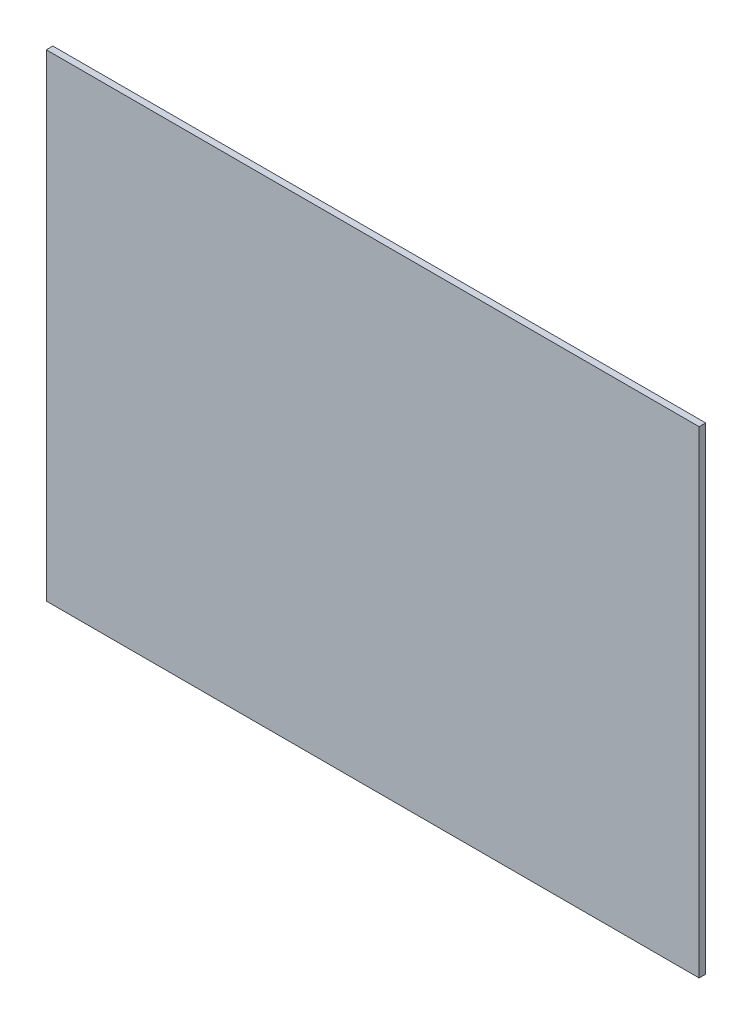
ISO-10303-21;
HEADER;
FILE_DESCRIPTION(('STEP AP214'),'2;1');
FILE_NAME('part.step','',(''),(''),'','','');
FILE_SCHEMA(('AUTOMOTIVE_DESIGN { 1 0 10303 214 1 1 1 1 }'));
ENDSEC;
DATA;
#1=APPLICATION_CONTEXT('core data for automotive mechanical design processes');
#2=APPLICATION_PROTOCOL_DEFINITION('international standard','automotive_design',2000,#1);
#3=PRODUCT_CONTEXT('',#1,'mechanical');
#4=PRODUCT('Part','Part','',(#3));
#5=PRODUCT_RELATED_PRODUCT_CATEGORY('part','',(#4));
#6=PRODUCT_DEFINITION_FORMATION('','',#4);
#7=PRODUCT_DEFINITION_CONTEXT('part definition',#1,'design');
#8=PRODUCT_DEFINITION('design','',#6,#7);
#9=PRODUCT_DEFINITION_SHAPE('','',#8);
#10=(LENGTH_UNIT() NAMED_UNIT(*) SI_UNIT(.MILLI.,.METRE.));
#11=(NAMED_UNIT(*) PLANE_ANGLE_UNIT() SI_UNIT($,.RADIAN.));
#12=(NAMED_UNIT(*) SI_UNIT($,.STERADIAN.) SOLID_ANGLE_UNIT());
#13=UNCERTAINTY_MEASURE_WITH_UNIT(LENGTH_MEASURE(1.E-05),#10,'distance_accuracy_value','');
#14=(GEOMETRIC_REPRESENTATION_CONTEXT(3) GLOBAL_UNCERTAINTY_ASSIGNED_CONTEXT((#13)) GLOBAL_UNIT_ASSIGNED_CONTEXT((#10,
#11,#12)) REPRESENTATION_CONTEXT('',''));
#15=CARTESIAN_POINT('',(0.,0.,0.));
#16=DIRECTION('',(0.,0.,1.));
#17=DIRECTION('',(1.,0.,0.));
#18=AXIS2_PLACEMENT_3D('',#15,#16,#17);
#19=CARTESIAN_POINT('',(-423.235950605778,344.955172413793,10.));
#20=DIRECTION('',(1.,0.,0.));
#21=DIRECTION('',(0.,1.,0.));
#22=AXIS2_PLACEMENT_3D('',#19,#20,#21);
#23=PLANE('',#22);
#24=DIRECTION('',(0.,-1.,0.));
#25=VECTOR('',#24,1.);
#26=CARTESIAN_POINT('',(-423.235950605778,344.955172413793,0.));
#27=LINE('',#26,#25);
#28=CARTESIAN_POINT('',(-423.235950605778,344.955172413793,0.));
#29=VERTEX_POINT('',#28);
#30=CARTESIAN_POINT('',(-423.235950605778,-385.044827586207,0.));
#31=VERTEX_POINT('',#30);
#32=EDGE_CURVE('E115',#29,#31,#27,.T.);
#33=ORIENTED_EDGE('',*,*,#32,.T.);
#34=DIRECTION('',(0.,0.,-1.));
#35=VECTOR('',#34,1.);
#36=CARTESIAN_POINT('',(-423.235950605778,-385.044827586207,10.));
#37=LINE('',#36,#35);
#38=CARTESIAN_POINT('',(-423.235950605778,-385.044827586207,10.));
#39=VERTEX_POINT('',#38);
#40=EDGE_CURVE('E11',#39,#31,#37,.T.);
#41=ORIENTED_EDGE('',*,*,#40,.F.);
#42=DIRECTION('',(0.,-1.,0.));
#43=VECTOR('',#42,1.);
#44=CARTESIAN_POINT('',(-423.235950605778,344.955172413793,10.));
#45=LINE('',#44,#43);
#46=CARTESIAN_POINT('',(-423.235950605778,344.955172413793,10.));
#47=VERTEX_POINT('',#46);
#48=EDGE_CURVE('E99',#47,#39,#45,.T.);
#49=ORIENTED_EDGE('',*,*,#48,.F.);
#50=DIRECTION('',(0.,0.,-1.));
#51=VECTOR('',#50,1.);
#52=CARTESIAN_POINT('',(-423.235950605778,344.955172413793,10.));
#53=LINE('',#52,#51);
#54=EDGE_CURVE('E111',#47,#29,#53,.T.);
#55=ORIENTED_EDGE('',*,*,#54,.T.);
#56=EDGE_LOOP('',(#33,#41,#49,#55));
#57=FACE_BOUND('',#56,.T.);
#58=ADVANCED_FACE('F47',(#57),#23,.F.);
#59=CARTESIAN_POINT('',(-423.235950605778,-385.044827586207,10.));
#60=DIRECTION('',(0.,1.,0.));
#61=DIRECTION('',(0.,0.,1.));
#62=AXIS2_PLACEMENT_3D('',#59,#60,#61);
#63=PLANE('',#62);
#64=DIRECTION('',(1.,0.,0.));
#65=VECTOR('',#64,1.);
#66=CARTESIAN_POINT('',(-423.235950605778,-385.044827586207,0.));
#67=LINE('',#66,#65);
#68=CARTESIAN_POINT('',(574.964049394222,-385.044827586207,0.));
#69=VERTEX_POINT('',#68);
#70=EDGE_CURVE('E104',#31,#69,#67,.T.);
#71=ORIENTED_EDGE('',*,*,#70,.T.);
#72=DIRECTION('',(0.,0.,-1.));
#73=VECTOR('',#72,1.);
#74=CARTESIAN_POINT('',(574.964049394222,-385.044827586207,10.));
#75=LINE('',#74,#73);
#76=CARTESIAN_POINT('',(574.964049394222,-385.044827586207,10.));
#77=VERTEX_POINT('',#76);
#78=EDGE_CURVE('E56',#77,#69,#75,.T.);
#79=ORIENTED_EDGE('',*,*,#78,.F.);
#80=DIRECTION('',(1.,0.,0.));
#81=VECTOR('',#80,1.);
#82=CARTESIAN_POINT('',(-423.235950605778,-385.044827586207,10.));
#83=LINE('',#82,#81);
#84=EDGE_CURVE('E94',#39,#77,#83,.T.);
#85=ORIENTED_EDGE('',*,*,#84,.F.);
#86=ORIENTED_EDGE('',*,*,#40,.T.);
#87=EDGE_LOOP('',(#71,#79,#85,#86));
#88=FACE_BOUND('',#87,.T.);
#89=ADVANCED_FACE('F103',(#88),#63,.F.);
#90=CARTESIAN_POINT('',(574.964049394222,344.955172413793,10.));
#91=DIRECTION('',(-1.,0.,0.));
#92=DIRECTION('',(0.,-1.,0.));
#93=AXIS2_PLACEMENT_3D('',#90,#91,#92);
#94=PLANE('',#93);
#95=DIRECTION('',(0.,1.,0.));
#96=VECTOR('',#95,1.);
#97=CARTESIAN_POINT('',(574.964049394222,344.955172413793,0.));
#98=LINE('',#97,#96);
#99=CARTESIAN_POINT('',(574.964049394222,344.955172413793,0.));
#100=VERTEX_POINT('',#99);
#101=EDGE_CURVE('E81',#69,#100,#98,.T.);
#102=ORIENTED_EDGE('',*,*,#101,.T.);
#103=DIRECTION('',(0.,0.,-1.));
#104=VECTOR('',#103,1.);
#105=CARTESIAN_POINT('',(574.964049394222,344.955172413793,10.));
#106=LINE('',#105,#104);
#107=CARTESIAN_POINT('',(574.964049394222,344.955172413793,10.));
#108=VERTEX_POINT('',#107);
#109=EDGE_CURVE('E106',#108,#100,#106,.T.);
#110=ORIENTED_EDGE('',*,*,#109,.F.);
#111=DIRECTION('',(0.,1.,0.));
#112=VECTOR('',#111,1.);
#113=CARTESIAN_POINT('',(574.964049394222,344.955172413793,10.));
#114=LINE('',#113,#112);
#115=EDGE_CURVE('E97',#77,#108,#114,.T.);
#116=ORIENTED_EDGE('',*,*,#115,.F.);
#117=ORIENTED_EDGE('',*,*,#78,.T.);
#118=EDGE_LOOP('',(#102,#110,#116,#117));
#119=FACE_BOUND('',#118,.T.);
#120=ADVANCED_FACE('F107',(#119),#94,.F.);
#121=CARTESIAN_POINT('',(-423.235950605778,344.955172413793,10.));
#122=DIRECTION('',(0.,-1.,0.));
#123=DIRECTION('',(0.,0.,-1.));
#124=AXIS2_PLACEMENT_3D('',#121,#122,#123);
#125=PLANE('',#124);
#126=DIRECTION('',(-1.,0.,0.));
#127=VECTOR('',#126,1.);
#128=CARTESIAN_POINT('',(-423.235950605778,344.955172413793,0.));
#129=LINE('',#128,#127);
#130=EDGE_CURVE('E87',#100,#29,#129,.T.);
#131=ORIENTED_EDGE('',*,*,#130,.T.);
#132=ORIENTED_EDGE('',*,*,#54,.F.);
#133=DIRECTION('',(-1.,0.,0.));
#134=VECTOR('',#133,1.);
#135=CARTESIAN_POINT('',(-423.235950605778,344.955172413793,10.));
#136=LINE('',#135,#134);
#137=EDGE_CURVE('E64',#108,#47,#136,.T.);
#138=ORIENTED_EDGE('',*,*,#137,.F.);
#139=ORIENTED_EDGE('',*,*,#109,.T.);
#140=EDGE_LOOP('',(#131,#132,#138,#139));
#141=FACE_BOUND('',#140,.T.);
#142=ADVANCED_FACE('F128',(#141),#125,.F.);
#143=CARTESIAN_POINT('',(0.,0.,10.));
#144=DIRECTION('',(0.,0.,1.));
#145=DIRECTION('',(1.,0.,0.));
#146=AXIS2_PLACEMENT_3D('',#143,#144,#145);
#147=PLANE('',#146);
#148=ORIENTED_EDGE('',*,*,#48,.T.);
#149=ORIENTED_EDGE('',*,*,#84,.T.);
#150=ORIENTED_EDGE('',*,*,#115,.T.);
#151=ORIENTED_EDGE('',*,*,#137,.T.);
#152=EDGE_LOOP('',(#148,#149,#150,#151));
#153=FACE_BOUND('',#152,.T.);
#154=ADVANCED_FACE('F95',(#153),#147,.T.);
#155=CARTESIAN_POINT('',(0.,0.,0.));
#156=DIRECTION('',(0.,0.,1.));
#157=DIRECTION('',(1.,0.,0.));
#158=AXIS2_PLACEMENT_3D('',#155,#156,#157);
#159=PLANE('',#158);
#160=ORIENTED_EDGE('',*,*,#32,.F.);
#161=ORIENTED_EDGE('',*,*,#130,.F.);
#162=ORIENTED_EDGE('',*,*,#101,.F.);
#163=ORIENTED_EDGE('',*,*,#70,.F.);
#164=EDGE_LOOP('',(#160,#161,#162,#163));
#165=FACE_BOUND('',#164,.T.);
#166=ADVANCED_FACE('F131',(#165),#159,.F.);
#167=CLOSED_SHELL('',(#58,#89,#120,#142,#154,#166));
#168=MANIFOLD_SOLID_BREP('B2',#167);
#169=ADVANCED_BREP_SHAPE_REPRESENTATION('',(#18,#168),#14);
#170=SHAPE_DEFINITION_REPRESENTATION(#9,#169);
ENDSEC;
END-ISO-10303-21;
